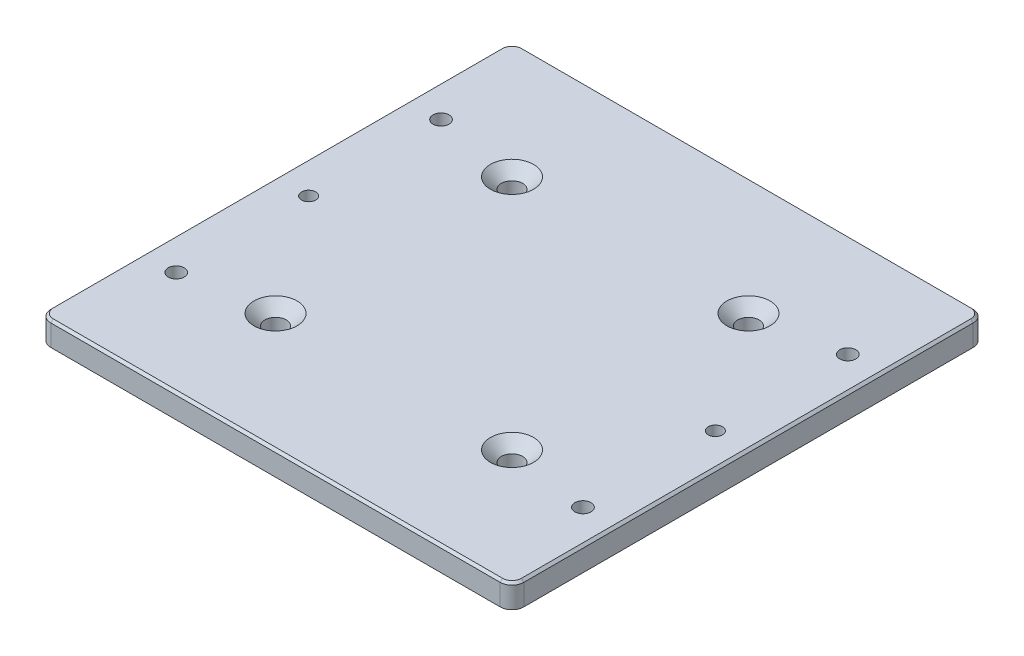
from build123d import *

# Parameters (mm, degrees)
SKIZZE1_W                                            = 200
SKIZZE1_H                                            = 200
AUFSATZ_LINEAR_AUSTRAGEN1_DEPTH                      = 10
M8_GEWINDEBOHRUNG1_D                                 = 6.8
FORMSENKUNG_F_R_M8_SENKSCHRAUBE_MIT_INNE_D           = 9
FORMSENKUNG_F_R_M8_SENKSCHRAUBE_MIT_INNE_CSINK_D     = 18.25
FORMSENKUNG_F_R_M8_SENKSCHRAUBE_MIT_INNE_CSINK_ANGLE = 90
F_6_0MM_STIFTLOCH1_D                                 = 6
VERRUNDUNG1_R                                        = 5
FASE1_SIZE                                           = 1


with BuildPart() as part:
    # Skizze1 → Aufsatz-Linear austragen1 (new body)
    with BuildSketch(Plane(origin=(0, 0, 0), x_dir=(1, 0, 0), z_dir=(0, 1, 0))):
        Rectangle(SKIZZE1_W, SKIZZE1_H)
    extrude(amount=-AUFSATZ_LINEAR_AUSTRAGEN1_DEPTH)

    # M8 Gewindebohrung1 (through all)
    with Locations(Plane(origin=(0, 0, 0), x_dir=(1, 0, 0), z_dir=(0, 1, 0))):
        with Locations((-86, -56), (86, 56), (-86, 56), (86, -56)):
            Hole(M8_GEWINDEBOHRUNG1_D / 2)

    # Formsenkung f_r M8 Senkschraube mit Inne (through all)
    with Locations(Plane(origin=(0, 0, 0), x_dir=(1, 0, 0), z_dir=(0, 1, 0))):
        with Locations((-50, -50), (50, 50), (-50, 50), (50, -50)):
            CounterSinkHole(FORMSENKUNG_F_R_M8_SENKSCHRAUBE_MIT_INNE_D / 2, FORMSENKUNG_F_R_M8_SENKSCHRAUBE_MIT_INNE_CSINK_D / 2, counter_sink_angle=FORMSENKUNG_F_R_M8_SENKSCHRAUBE_MIT_INNE_CSINK_ANGLE)

    # 6.0mm Stiftloch1 (through all)
    with Locations(Plane(origin=(0, 0, 0), x_dir=(1, 0, 0), z_dir=(0, 1, 0))):
        with Locations((86, 0), (-86, 0)):
            Hole(F_6_0MM_STIFTLOCH1_D / 2)

    # Verrundung1
    verrundung1_edges = [part.edges().sort_by_distance(p)[0] for p in [
        (100, -5, 100),
        (-100, -5, 100),
        (-100, -5, -100),
        (100, -5, -100),
    ]]
    fillet(verrundung1_edges, radius=VERRUNDUNG1_R)

    # Fase1
    fase1_edges = [part.edges().sort_by_distance(p)[0] for p in [
        (100, 0, 0),
        (0, 0, -100),
        (-100, 0, 0),
        (0, 0, 100),
        (98.535533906, 0, 98.535533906),
        (-98.535533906, 0, 98.535533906),
        (-98.535533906, 0, -98.535533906),
        (98.535533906, 0, -98.535533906),
    ]]
    chamfer(fase1_edges, length=FASE1_SIZE)


solid = part.part
